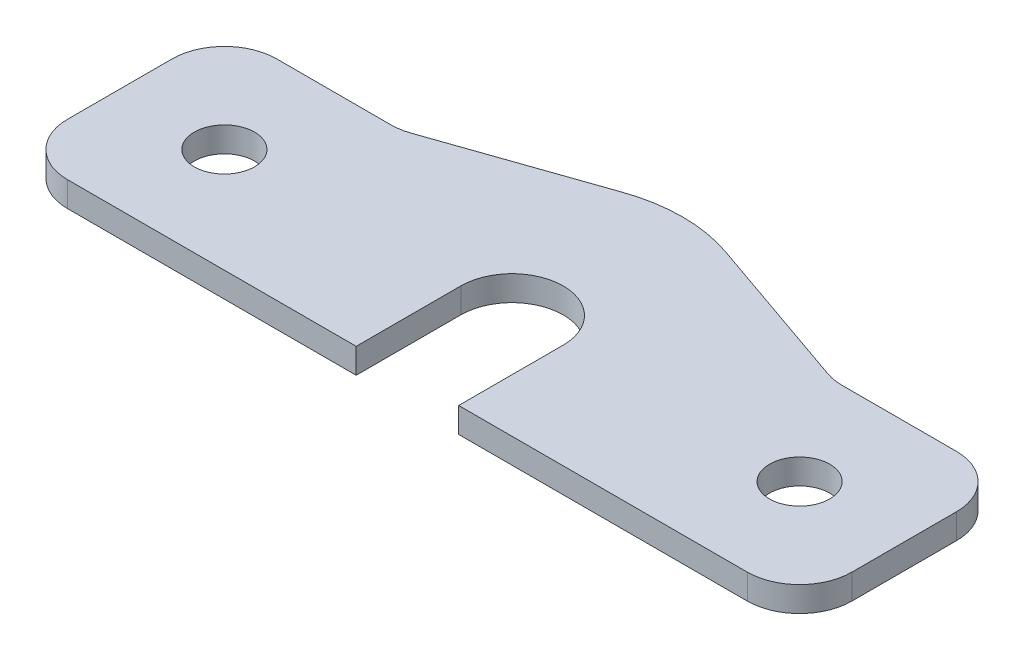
ISO-10303-21;
HEADER;
FILE_DESCRIPTION(('STEP AP214'),'2;1');
FILE_NAME('part.step','',(''),(''),'','','');
FILE_SCHEMA(('AUTOMOTIVE_DESIGN { 1 0 10303 214 1 1 1 1 }'));
ENDSEC;
DATA;
#1=APPLICATION_CONTEXT('core data for automotive mechanical design processes');
#2=APPLICATION_PROTOCOL_DEFINITION('international standard','automotive_design',2000,#1);
#3=PRODUCT_CONTEXT('',#1,'mechanical');
#4=PRODUCT('Part','Part','',(#3));
#5=PRODUCT_RELATED_PRODUCT_CATEGORY('part','',(#4));
#6=PRODUCT_DEFINITION_FORMATION('','',#4);
#7=PRODUCT_DEFINITION_CONTEXT('part definition',#1,'design');
#8=PRODUCT_DEFINITION('design','',#6,#7);
#9=PRODUCT_DEFINITION_SHAPE('','',#8);
#10=(LENGTH_UNIT() NAMED_UNIT(*) SI_UNIT(.MILLI.,.METRE.));
#11=(NAMED_UNIT(*) PLANE_ANGLE_UNIT() SI_UNIT($,.RADIAN.));
#12=(NAMED_UNIT(*) SI_UNIT($,.STERADIAN.) SOLID_ANGLE_UNIT());
#13=UNCERTAINTY_MEASURE_WITH_UNIT(LENGTH_MEASURE(1.E-05),#10,'distance_accuracy_value','');
#14=(GEOMETRIC_REPRESENTATION_CONTEXT(3) GLOBAL_UNCERTAINTY_ASSIGNED_CONTEXT((#13)) GLOBAL_UNIT_ASSIGNED_CONTEXT((#10,
#11,#12)) REPRESENTATION_CONTEXT('',''));
#15=CARTESIAN_POINT('',(0.,0.,0.));
#16=DIRECTION('',(0.,0.,1.));
#17=DIRECTION('',(1.,0.,0.));
#18=AXIS2_PLACEMENT_3D('',#15,#16,#17);
#19=CARTESIAN_POINT('',(0.,1.524,-0.838200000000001));
#20=DIRECTION('',(0.,1.,0.));
#21=DIRECTION('',(0.,0.,1.));
#22=AXIS2_PLACEMENT_3D('',#19,#20,#21);
#23=PLANE('',#22);
#24=CARTESIAN_POINT('',(17.4625,1.524,0.));
#25=DIRECTION('',(0.,1.,0.));
#26=DIRECTION('',(0.,0.,1.));
#27=AXIS2_PLACEMENT_3D('',#24,#25,#26);
#28=CIRCLE('',#27,1.8288);
#29=CARTESIAN_POINT('',(17.4625,1.524,-1.8288));
#30=VERTEX_POINT('',#29);
#31=EDGE_CURVE('E281',#30,#30,#28,.T.);
#32=ORIENTED_EDGE('',*,*,#31,.F.);
#33=EDGE_LOOP('',(#32));
#34=FACE_BOUND('',#33,.T.);
#35=DIRECTION('',(-1.,0.,0.));
#36=VECTOR('',#35,1.);
#37=CARTESIAN_POINT('',(-23.8125,1.524,-6.35));
#38=LINE('',#37,#36);
#39=CARTESIAN_POINT('',(-13.6985419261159,1.524,-6.35));
#40=VERTEX_POINT('',#39);
#41=CARTESIAN_POINT('',(-20.6375,1.524,-6.35));
#42=VERTEX_POINT('',#41);
#43=EDGE_CURVE('E264',#40,#42,#38,.T.);
#44=ORIENTED_EDGE('',*,*,#43,.T.);
#45=CARTESIAN_POINT('',(-20.6375,1.524,-3.175));
#46=DIRECTION('',(0.,1.,0.));
#47=DIRECTION('',(0.,0.,1.));
#48=AXIS2_PLACEMENT_3D('',#45,#46,#47);
#49=CIRCLE('',#48,3.175);
#50=CARTESIAN_POINT('',(-23.8125,1.524,-3.175));
#51=VERTEX_POINT('',#50);
#52=EDGE_CURVE('E224',#42,#51,#49,.T.);
#53=ORIENTED_EDGE('',*,*,#52,.T.);
#54=DIRECTION('',(0.,0.,1.));
#55=VECTOR('',#54,1.);
#56=CARTESIAN_POINT('',(-23.8125,1.524,6.35));
#57=LINE('',#56,#55);
#58=CARTESIAN_POINT('',(-23.8125,1.524,3.175));
#59=VERTEX_POINT('',#58);
#60=EDGE_CURVE('E270',#51,#59,#57,.T.);
#61=ORIENTED_EDGE('',*,*,#60,.T.);
#62=CARTESIAN_POINT('',(-20.6375,1.524,3.175));
#63=DIRECTION('',(0.,1.,0.));
#64=DIRECTION('',(0.,0.,1.));
#65=AXIS2_PLACEMENT_3D('',#62,#63,#64);
#66=CIRCLE('',#65,3.175);
#67=CARTESIAN_POINT('',(-20.6375,1.524,6.35));
#68=VERTEX_POINT('',#67);
#69=EDGE_CURVE('E50',#59,#68,#66,.T.);
#70=ORIENTED_EDGE('',*,*,#69,.T.);
#71=DIRECTION('',(1.,0.,0.));
#72=VECTOR('',#71,1.);
#73=CARTESIAN_POINT('',(-23.8125,1.524,6.35));
#74=LINE('',#73,#72);
#75=CARTESIAN_POINT('',(-3.1115,1.524,6.35));
#76=VERTEX_POINT('',#75);
#77=EDGE_CURVE('E177',#68,#76,#74,.T.);
#78=ORIENTED_EDGE('',*,*,#77,.T.);
#79=DIRECTION('',(0.,0.,-1.));
#80=VECTOR('',#79,1.);
#81=CARTESIAN_POINT('',(-3.1115,1.524,0.));
#82=LINE('',#81,#80);
#83=CARTESIAN_POINT('',(-3.1115,1.524,0.));
#84=VERTEX_POINT('',#83);
#85=EDGE_CURVE('E172',#76,#84,#82,.T.);
#86=ORIENTED_EDGE('',*,*,#85,.T.);
#87=CARTESIAN_POINT('',(0.,1.524,0.));
#88=DIRECTION('',(0.,-1.,0.));
#89=DIRECTION('',(0.,0.,1.));
#90=AXIS2_PLACEMENT_3D('',#87,#88,#89);
#91=CIRCLE('',#90,3.1115);
#92=CARTESIAN_POINT('',(3.1115,1.524,0.));
#93=VERTEX_POINT('',#92);
#94=EDGE_CURVE('E162',#84,#93,#91,.T.);
#95=ORIENTED_EDGE('',*,*,#94,.T.);
#96=DIRECTION('',(0.,0.,1.));
#97=VECTOR('',#96,1.);
#98=CARTESIAN_POINT('',(3.1115,1.524,0.));
#99=LINE('',#98,#97);
#100=CARTESIAN_POINT('',(3.1115,1.524,6.35));
#101=VERTEX_POINT('',#100);
#102=EDGE_CURVE('E171',#93,#101,#99,.T.);
#103=ORIENTED_EDGE('',*,*,#102,.T.);
#104=DIRECTION('',(1.,0.,0.));
#105=VECTOR('',#104,1.);
#106=CARTESIAN_POINT('',(3.1115,1.524,6.35));
#107=LINE('',#106,#105);
#108=CARTESIAN_POINT('',(20.6375,1.524,6.35));
#109=VERTEX_POINT('',#108);
#110=EDGE_CURVE('E313',#101,#109,#107,.T.);
#111=ORIENTED_EDGE('',*,*,#110,.T.);
#112=CARTESIAN_POINT('',(20.6375,1.524,3.175));
#113=DIRECTION('',(0.,1.,0.));
#114=DIRECTION('',(0.,0.,1.));
#115=AXIS2_PLACEMENT_3D('',#112,#113,#114);
#116=CIRCLE('',#115,3.175);
#117=CARTESIAN_POINT('',(23.8125,1.524,3.175));
#118=VERTEX_POINT('',#117);
#119=EDGE_CURVE('E219',#109,#118,#116,.T.);
#120=ORIENTED_EDGE('',*,*,#119,.T.);
#121=DIRECTION('',(0.,0.,-1.));
#122=VECTOR('',#121,1.);
#123=CARTESIAN_POINT('',(23.8125,1.524,6.35));
#124=LINE('',#123,#122);
#125=CARTESIAN_POINT('',(23.8125,1.524,-3.175));
#126=VERTEX_POINT('',#125);
#127=EDGE_CURVE('E321',#118,#126,#124,.T.);
#128=ORIENTED_EDGE('',*,*,#127,.T.);
#129=CARTESIAN_POINT('',(20.6375,1.524,-3.175));
#130=DIRECTION('',(0.,1.,0.));
#131=DIRECTION('',(0.,0.,1.));
#132=AXIS2_PLACEMENT_3D('',#129,#130,#131);
#133=CIRCLE('',#132,3.175);
#134=CARTESIAN_POINT('',(20.6375,1.524,-6.35));
#135=VERTEX_POINT('',#134);
#136=EDGE_CURVE('E222',#126,#135,#133,.T.);
#137=ORIENTED_EDGE('',*,*,#136,.T.);
#138=DIRECTION('',(-1.,0.,0.));
#139=VECTOR('',#138,1.);
#140=CARTESIAN_POINT('',(23.8125,1.524,-6.35));
#141=LINE('',#140,#139);
#142=CARTESIAN_POINT('',(13.6985419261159,1.524,-6.35));
#143=VERTEX_POINT('',#142);
#144=EDGE_CURVE('E323',#135,#143,#141,.T.);
#145=ORIENTED_EDGE('',*,*,#144,.T.);
#146=CARTESIAN_POINT('',(13.6985419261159,1.524,-9.525));
#147=DIRECTION('',(0.,1.,0.));
#148=DIRECTION('',(0.,0.,1.));
#149=AXIS2_PLACEMENT_3D('',#146,#147,#148);
#150=CIRCLE('',#149,3.175);
#151=CARTESIAN_POINT('',(12.6569481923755,1.524,-6.52571550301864));
#152=VERTEX_POINT('',#151);
#153=EDGE_CURVE('E237',#143,#152,#150,.F.);
#154=ORIENTED_EDGE('',*,*,#153,.T.);
#155=DIRECTION('',(-0.94465653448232,0.,-0.328061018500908));
#156=VECTOR('',#155,1.);
#157=CARTESIAN_POINT('',(13.1629235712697,1.524,-6.35));
#158=LINE('',#157,#156);
#159=CARTESIAN_POINT('',(3.12478120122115,1.524,-9.8360534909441));
#160=VERTEX_POINT('',#159);
#161=EDGE_CURVE('E326',#152,#160,#158,.T.);
#162=ORIENTED_EDGE('',*,*,#161,.T.);
#163=CARTESIAN_POINT('',(0.,1.524,-0.838200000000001));
#164=DIRECTION('',(0.,1.,0.));
#165=DIRECTION('',(0.,0.,1.));
#166=AXIS2_PLACEMENT_3D('',#163,#164,#165);
#167=CIRCLE('',#166,9.525);
#168=CARTESIAN_POINT('',(-3.12478120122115,1.524,-9.8360534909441));
#169=VERTEX_POINT('',#168);
#170=EDGE_CURVE('E273',#160,#169,#167,.T.);
#171=ORIENTED_EDGE('',*,*,#170,.T.);
#172=DIRECTION('',(-0.94465653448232,0.,0.328061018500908));
#173=VECTOR('',#172,1.);
#174=CARTESIAN_POINT('',(-13.1629235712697,1.524,-6.35));
#175=LINE('',#174,#173);
#176=CARTESIAN_POINT('',(-12.6569481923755,1.524,-6.52571550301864));
#177=VERTEX_POINT('',#176);
#178=EDGE_CURVE('E266',#169,#177,#175,.T.);
#179=ORIENTED_EDGE('',*,*,#178,.T.);
#180=CARTESIAN_POINT('',(-13.6985419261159,1.524,-9.525));
#181=DIRECTION('',(0.,1.,0.));
#182=DIRECTION('',(0.,0.,1.));
#183=AXIS2_PLACEMENT_3D('',#180,#181,#182);
#184=CIRCLE('',#183,3.175);
#185=EDGE_CURVE('E11',#177,#40,#184,.F.);
#186=ORIENTED_EDGE('',*,*,#185,.T.);
#187=EDGE_LOOP('',(#44,#53,#61,#70,#78,#86,#95,#103,#111,#120,#128,#137,#145,#154,#162,#171,
#179,#186));
#188=FACE_BOUND('',#187,.T.);
#189=CARTESIAN_POINT('',(-17.4625,1.524,0.));
#190=DIRECTION('',(0.,1.,0.));
#191=DIRECTION('',(0.,0.,-1.));
#192=AXIS2_PLACEMENT_3D('',#189,#190,#191);
#193=CIRCLE('',#192,1.8288);
#194=CARTESIAN_POINT('',(-17.4625,1.524,-1.8288));
#195=VERTEX_POINT('',#194);
#196=EDGE_CURVE('E546',#195,#195,#193,.T.);
#197=ORIENTED_EDGE('',*,*,#196,.F.);
#198=EDGE_LOOP('',(#197));
#199=FACE_BOUND('',#198,.T.);
#200=ADVANCED_FACE('F35',(#34,#188,#199),#23,.T.);
#201=CARTESIAN_POINT('',(0.,0.,-0.838200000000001));
#202=DIRECTION('',(0.,1.,0.));
#203=DIRECTION('',(0.,0.,1.));
#204=AXIS2_PLACEMENT_3D('',#201,#202,#203);
#205=PLANE('',#204);
#206=CARTESIAN_POINT('',(17.4625,0.,0.));
#207=DIRECTION('',(0.,1.,0.));
#208=DIRECTION('',(0.,0.,1.));
#209=AXIS2_PLACEMENT_3D('',#206,#207,#208);
#210=CIRCLE('',#209,1.8288);
#211=CARTESIAN_POINT('',(17.4625,0.,-1.8288));
#212=VERTEX_POINT('',#211);
#213=EDGE_CURVE('E545',#212,#212,#210,.T.);
#214=ORIENTED_EDGE('',*,*,#213,.T.);
#215=EDGE_LOOP('',(#214));
#216=FACE_BOUND('',#215,.T.);
#217=DIRECTION('',(0.,0.,1.));
#218=VECTOR('',#217,1.);
#219=CARTESIAN_POINT('',(-23.8125,0.,6.35));
#220=LINE('',#219,#218);
#221=CARTESIAN_POINT('',(-23.8125,0.,-3.175));
#222=VERTEX_POINT('',#221);
#223=CARTESIAN_POINT('',(-23.8125,0.,3.175));
#224=VERTEX_POINT('',#223);
#225=EDGE_CURVE('E297',#222,#224,#220,.T.);
#226=ORIENTED_EDGE('',*,*,#225,.F.);
#227=CARTESIAN_POINT('',(-20.6375,0.,-3.175));
#228=DIRECTION('',(0.,1.,0.));
#229=DIRECTION('',(0.,0.,1.));
#230=AXIS2_PLACEMENT_3D('',#227,#228,#229);
#231=CIRCLE('',#230,3.175);
#232=CARTESIAN_POINT('',(-20.6375,0.,-6.35));
#233=VERTEX_POINT('',#232);
#234=EDGE_CURVE('E217',#222,#233,#231,.F.);
#235=ORIENTED_EDGE('',*,*,#234,.T.);
#236=DIRECTION('',(-1.,0.,0.));
#237=VECTOR('',#236,1.);
#238=CARTESIAN_POINT('',(-23.8125,0.,-6.35));
#239=LINE('',#238,#237);
#240=CARTESIAN_POINT('',(-13.6985419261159,0.,-6.35));
#241=VERTEX_POINT('',#240);
#242=EDGE_CURVE('E248',#241,#233,#239,.T.);
#243=ORIENTED_EDGE('',*,*,#242,.F.);
#244=CARTESIAN_POINT('',(-13.6985419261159,0.,-9.525));
#245=DIRECTION('',(0.,1.,0.));
#246=DIRECTION('',(0.,0.,1.));
#247=AXIS2_PLACEMENT_3D('',#244,#245,#246);
#248=CIRCLE('',#247,3.175);
#249=CARTESIAN_POINT('',(-12.6569481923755,0.,-6.52571550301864));
#250=VERTEX_POINT('',#249);
#251=EDGE_CURVE('E43',#241,#250,#248,.T.);
#252=ORIENTED_EDGE('',*,*,#251,.T.);
#253=DIRECTION('',(-0.94465653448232,0.,0.328061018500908));
#254=VECTOR('',#253,1.);
#255=CARTESIAN_POINT('',(-13.1629235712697,0.,-6.35));
#256=LINE('',#255,#254);
#257=CARTESIAN_POINT('',(-3.12478120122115,0.,-9.8360534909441));
#258=VERTEX_POINT('',#257);
#259=EDGE_CURVE('E246',#258,#250,#256,.T.);
#260=ORIENTED_EDGE('',*,*,#259,.F.);
#261=CARTESIAN_POINT('',(0.,0.,-0.838200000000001));
#262=DIRECTION('',(0.,1.,0.));
#263=DIRECTION('',(0.,0.,1.));
#264=AXIS2_PLACEMENT_3D('',#261,#262,#263);
#265=CIRCLE('',#264,9.525);
#266=CARTESIAN_POINT('',(3.12478120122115,0.,-9.8360534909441));
#267=VERTEX_POINT('',#266);
#268=EDGE_CURVE('E259',#267,#258,#265,.T.);
#269=ORIENTED_EDGE('',*,*,#268,.F.);
#270=DIRECTION('',(-0.94465653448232,0.,-0.328061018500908));
#271=VECTOR('',#270,1.);
#272=CARTESIAN_POINT('',(13.1629235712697,0.,-6.35));
#273=LINE('',#272,#271);
#274=CARTESIAN_POINT('',(12.6569481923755,0.,-6.52571550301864));
#275=VERTEX_POINT('',#274);
#276=EDGE_CURVE('E293',#275,#267,#273,.T.);
#277=ORIENTED_EDGE('',*,*,#276,.F.);
#278=CARTESIAN_POINT('',(13.6985419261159,0.,-9.525));
#279=DIRECTION('',(0.,1.,0.));
#280=DIRECTION('',(0.,0.,1.));
#281=AXIS2_PLACEMENT_3D('',#278,#279,#280);
#282=CIRCLE('',#281,3.175);
#283=CARTESIAN_POINT('',(13.6985419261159,0.,-6.35));
#284=VERTEX_POINT('',#283);
#285=EDGE_CURVE('E235',#275,#284,#282,.T.);
#286=ORIENTED_EDGE('',*,*,#285,.T.);
#287=DIRECTION('',(-1.,0.,0.));
#288=VECTOR('',#287,1.);
#289=CARTESIAN_POINT('',(23.8125,0.,-6.35));
#290=LINE('',#289,#288);
#291=CARTESIAN_POINT('',(20.6375,0.,-6.35));
#292=VERTEX_POINT('',#291);
#293=EDGE_CURVE('E290',#292,#284,#290,.T.);
#294=ORIENTED_EDGE('',*,*,#293,.F.);
#295=CARTESIAN_POINT('',(20.6375,0.,-3.175));
#296=DIRECTION('',(0.,1.,0.));
#297=DIRECTION('',(0.,0.,1.));
#298=AXIS2_PLACEMENT_3D('',#295,#296,#297);
#299=CIRCLE('',#298,3.175);
#300=CARTESIAN_POINT('',(23.8125,0.,-3.175));
#301=VERTEX_POINT('',#300);
#302=EDGE_CURVE('E215',#292,#301,#299,.F.);
#303=ORIENTED_EDGE('',*,*,#302,.T.);
#304=DIRECTION('',(0.,0.,-1.));
#305=VECTOR('',#304,1.);
#306=CARTESIAN_POINT('',(23.8125,0.,6.35));
#307=LINE('',#306,#305);
#308=CARTESIAN_POINT('',(23.8125,0.,3.175));
#309=VERTEX_POINT('',#308);
#310=EDGE_CURVE('E288',#309,#301,#307,.T.);
#311=ORIENTED_EDGE('',*,*,#310,.F.);
#312=CARTESIAN_POINT('',(20.6375,0.,3.175));
#313=DIRECTION('',(0.,1.,0.));
#314=DIRECTION('',(0.,0.,1.));
#315=AXIS2_PLACEMENT_3D('',#312,#313,#314);
#316=CIRCLE('',#315,3.175);
#317=CARTESIAN_POINT('',(20.6375,0.,6.35));
#318=VERTEX_POINT('',#317);
#319=EDGE_CURVE('E211',#309,#318,#316,.F.);
#320=ORIENTED_EDGE('',*,*,#319,.T.);
#321=DIRECTION('',(1.,0.,0.));
#322=VECTOR('',#321,1.);
#323=CARTESIAN_POINT('',(3.1115,0.,6.35));
#324=LINE('',#323,#322);
#325=CARTESIAN_POINT('',(3.1115,0.,6.35));
#326=VERTEX_POINT('',#325);
#327=EDGE_CURVE('E285',#326,#318,#324,.T.);
#328=ORIENTED_EDGE('',*,*,#327,.F.);
#329=DIRECTION('',(0.,0.,1.));
#330=VECTOR('',#329,1.);
#331=CARTESIAN_POINT('',(3.1115,0.,0.));
#332=LINE('',#331,#330);
#333=CARTESIAN_POINT('',(3.1115,0.,0.));
#334=VERTEX_POINT('',#333);
#335=EDGE_CURVE('E283',#334,#326,#332,.T.);
#336=ORIENTED_EDGE('',*,*,#335,.F.);
#337=CARTESIAN_POINT('',(0.,0.,0.));
#338=DIRECTION('',(0.,-1.,0.));
#339=DIRECTION('',(0.,0.,1.));
#340=AXIS2_PLACEMENT_3D('',#337,#338,#339);
#341=CIRCLE('',#340,3.1115);
#342=CARTESIAN_POINT('',(-3.1115,0.,0.));
#343=VERTEX_POINT('',#342);
#344=EDGE_CURVE('E280',#343,#334,#341,.T.);
#345=ORIENTED_EDGE('',*,*,#344,.F.);
#346=DIRECTION('',(0.,0.,-1.));
#347=VECTOR('',#346,1.);
#348=CARTESIAN_POINT('',(-3.1115,0.,0.));
#349=LINE('',#348,#347);
#350=CARTESIAN_POINT('',(-3.1115,0.,6.35));
#351=VERTEX_POINT('',#350);
#352=EDGE_CURVE('E185',#351,#343,#349,.T.);
#353=ORIENTED_EDGE('',*,*,#352,.F.);
#354=DIRECTION('',(1.,0.,0.));
#355=VECTOR('',#354,1.);
#356=CARTESIAN_POINT('',(-23.8125,0.,6.35));
#357=LINE('',#356,#355);
#358=CARTESIAN_POINT('',(-20.6375,0.,6.35));
#359=VERTEX_POINT('',#358);
#360=EDGE_CURVE('E181',#359,#351,#357,.T.);
#361=ORIENTED_EDGE('',*,*,#360,.F.);
#362=CARTESIAN_POINT('',(-20.6375,0.,3.175));
#363=DIRECTION('',(0.,1.,0.));
#364=DIRECTION('',(0.,0.,1.));
#365=AXIS2_PLACEMENT_3D('',#362,#363,#364);
#366=CIRCLE('',#365,3.175);
#367=EDGE_CURVE('E213',#359,#224,#366,.F.);
#368=ORIENTED_EDGE('',*,*,#367,.T.);
#369=EDGE_LOOP('',(#226,#235,#243,#252,#260,#269,#277,#286,#294,#303,#311,#320,#328,#336,#345,
#353,#361,#368));
#370=FACE_BOUND('',#369,.T.);
#371=CARTESIAN_POINT('',(-17.4625,0.,0.));
#372=DIRECTION('',(0.,1.,0.));
#373=DIRECTION('',(0.,0.,-1.));
#374=AXIS2_PLACEMENT_3D('',#371,#372,#373);
#375=CIRCLE('',#374,1.8288);
#376=CARTESIAN_POINT('',(-17.4625,0.,-1.8288));
#377=VERTEX_POINT('',#376);
#378=EDGE_CURVE('E550',#377,#377,#375,.T.);
#379=ORIENTED_EDGE('',*,*,#378,.T.);
#380=EDGE_LOOP('',(#379));
#381=FACE_BOUND('',#380,.T.);
#382=ADVANCED_FACE('F243',(#216,#370,#381),#205,.F.);
#383=CARTESIAN_POINT('',(-3.1115,1.524,0.));
#384=DIRECTION('',(-1.,0.,0.));
#385=DIRECTION('',(0.,0.,1.));
#386=AXIS2_PLACEMENT_3D('',#383,#384,#385);
#387=PLANE('',#386);
#388=ORIENTED_EDGE('',*,*,#352,.T.);
#389=DIRECTION('',(0.,-1.,0.));
#390=VECTOR('',#389,1.);
#391=CARTESIAN_POINT('',(-3.1115,1.524,0.));
#392=LINE('',#391,#390);
#393=EDGE_CURVE('E166',#84,#343,#392,.T.);
#394=ORIENTED_EDGE('',*,*,#393,.F.);
#395=ORIENTED_EDGE('',*,*,#85,.F.);
#396=DIRECTION('',(0.,-1.,0.));
#397=VECTOR('',#396,1.);
#398=CARTESIAN_POINT('',(-3.1115,1.524,6.35));
#399=LINE('',#398,#397);
#400=EDGE_CURVE('E278',#76,#351,#399,.T.);
#401=ORIENTED_EDGE('',*,*,#400,.T.);
#402=EDGE_LOOP('',(#388,#394,#395,#401));
#403=FACE_BOUND('',#402,.T.);
#404=ADVANCED_FACE('F183',(#403),#387,.F.);
#405=CARTESIAN_POINT('',(0.,1.524,0.));
#406=DIRECTION('',(0.,-1.,0.));
#407=DIRECTION('',(0.,0.,-1.));
#408=AXIS2_PLACEMENT_3D('',#405,#406,#407);
#409=CYLINDRICAL_SURFACE('',#408,3.1115);
#410=ORIENTED_EDGE('',*,*,#344,.T.);
#411=DIRECTION('',(0.,-1.,0.));
#412=VECTOR('',#411,1.);
#413=CARTESIAN_POINT('',(3.1115,1.524,0.));
#414=LINE('',#413,#412);
#415=EDGE_CURVE('E169',#93,#334,#414,.T.);
#416=ORIENTED_EDGE('',*,*,#415,.F.);
#417=ORIENTED_EDGE('',*,*,#94,.F.);
#418=ORIENTED_EDGE('',*,*,#393,.T.);
#419=EDGE_LOOP('',(#410,#416,#417,#418));
#420=FACE_BOUND('',#419,.T.);
#421=ADVANCED_FACE('F164',(#420),#409,.F.);
#422=CARTESIAN_POINT('',(3.1115,1.524,0.));
#423=DIRECTION('',(1.,0.,0.));
#424=DIRECTION('',(0.,0.,-1.));
#425=AXIS2_PLACEMENT_3D('',#422,#423,#424);
#426=PLANE('',#425);
#427=ORIENTED_EDGE('',*,*,#335,.T.);
#428=DIRECTION('',(0.,-1.,0.));
#429=VECTOR('',#428,1.);
#430=CARTESIAN_POINT('',(3.1115,1.524,6.35));
#431=LINE('',#430,#429);
#432=EDGE_CURVE('E191',#101,#326,#431,.T.);
#433=ORIENTED_EDGE('',*,*,#432,.F.);
#434=ORIENTED_EDGE('',*,*,#102,.F.);
#435=ORIENTED_EDGE('',*,*,#415,.T.);
#436=EDGE_LOOP('',(#427,#433,#434,#435));
#437=FACE_BOUND('',#436,.T.);
#438=ADVANCED_FACE('F397',(#437),#426,.F.);
#439=CARTESIAN_POINT('',(3.1115,1.524,6.35));
#440=DIRECTION('',(0.,0.,-1.));
#441=DIRECTION('',(-1.,0.,0.));
#442=AXIS2_PLACEMENT_3D('',#439,#440,#441);
#443=PLANE('',#442);
#444=ORIENTED_EDGE('',*,*,#327,.T.);
#445=DIRECTION('',(0.,-1.,0.));
#446=VECTOR('',#445,1.);
#447=CARTESIAN_POINT('',(20.6375,1.524,6.35));
#448=LINE('',#447,#446);
#449=EDGE_CURVE('E233',#318,#109,#448,.F.);
#450=ORIENTED_EDGE('',*,*,#449,.T.);
#451=ORIENTED_EDGE('',*,*,#110,.F.);
#452=ORIENTED_EDGE('',*,*,#432,.T.);
#453=EDGE_LOOP('',(#444,#450,#451,#452));
#454=FACE_BOUND('',#453,.T.);
#455=ADVANCED_FACE('F310',(#454),#443,.F.);
#456=CARTESIAN_POINT('',(23.8125,1.524,6.35));
#457=DIRECTION('',(-1.,0.,0.));
#458=DIRECTION('',(0.,0.,1.));
#459=AXIS2_PLACEMENT_3D('',#456,#457,#458);
#460=PLANE('',#459);
#461=ORIENTED_EDGE('',*,*,#310,.T.);
#462=DIRECTION('',(0.,-1.,0.));
#463=VECTOR('',#462,1.);
#464=CARTESIAN_POINT('',(23.8125,1.524,-3.175));
#465=LINE('',#464,#463);
#466=EDGE_CURVE('E58',#301,#126,#465,.F.);
#467=ORIENTED_EDGE('',*,*,#466,.T.);
#468=ORIENTED_EDGE('',*,*,#127,.F.);
#469=DIRECTION('',(0.,-1.,0.));
#470=VECTOR('',#469,1.);
#471=CARTESIAN_POINT('',(23.8125,1.524,3.175));
#472=LINE('',#471,#470);
#473=EDGE_CURVE('E226',#118,#309,#472,.T.);
#474=ORIENTED_EDGE('',*,*,#473,.T.);
#475=EDGE_LOOP('',(#461,#467,#468,#474));
#476=FACE_BOUND('',#475,.T.);
#477=ADVANCED_FACE('F320',(#476),#460,.F.);
#478=CARTESIAN_POINT('',(23.8125,1.524,-6.35));
#479=DIRECTION('',(0.,0.,1.));
#480=DIRECTION('',(1.,0.,0.));
#481=AXIS2_PLACEMENT_3D('',#478,#479,#480);
#482=PLANE('',#481);
#483=ORIENTED_EDGE('',*,*,#293,.T.);
#484=DIRECTION('',(0.,-1.,0.));
#485=VECTOR('',#484,1.);
#486=CARTESIAN_POINT('',(13.6985419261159,1.524,-6.35));
#487=LINE('',#486,#485);
#488=EDGE_CURVE('E197',#284,#143,#487,.F.);
#489=ORIENTED_EDGE('',*,*,#488,.T.);
#490=ORIENTED_EDGE('',*,*,#144,.F.);
#491=DIRECTION('',(0.,-1.,0.));
#492=VECTOR('',#491,1.);
#493=CARTESIAN_POINT('',(20.6375,1.524,-6.35));
#494=LINE('',#493,#492);
#495=EDGE_CURVE('E189',#135,#292,#494,.T.);
#496=ORIENTED_EDGE('',*,*,#495,.T.);
#497=EDGE_LOOP('',(#483,#489,#490,#496));
#498=FACE_BOUND('',#497,.T.);
#499=ADVANCED_FACE('F347',(#498),#482,.F.);
#500=CARTESIAN_POINT('',(13.1629235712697,1.524,-6.35));
#501=DIRECTION('',(-0.328061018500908,0.,0.94465653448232));
#502=DIRECTION('',(0.94465653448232,0.,0.328061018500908));
#503=AXIS2_PLACEMENT_3D('',#500,#501,#502);
#504=PLANE('',#503);
#505=ORIENTED_EDGE('',*,*,#161,.F.);
#506=DIRECTION('',(0.,-1.,0.));
#507=VECTOR('',#506,1.);
#508=CARTESIAN_POINT('',(12.6569481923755,0.,-6.52571550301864));
#509=LINE('',#508,#507);
#510=EDGE_CURVE('E186',#152,#275,#509,.T.);
#511=ORIENTED_EDGE('',*,*,#510,.T.);
#512=ORIENTED_EDGE('',*,*,#276,.T.);
#513=DIRECTION('',(0.,-1.,0.));
#514=VECTOR('',#513,1.);
#515=CARTESIAN_POINT('',(3.12478120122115,1.524,-9.8360534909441));
#516=LINE('',#515,#514);
#517=EDGE_CURVE('E303',#160,#267,#516,.T.);
#518=ORIENTED_EDGE('',*,*,#517,.F.);
#519=EDGE_LOOP('',(#505,#511,#512,#518));
#520=FACE_BOUND('',#519,.T.);
#521=ADVANCED_FACE('F339',(#520),#504,.F.);
#522=CARTESIAN_POINT('',(0.,1.524,-0.838200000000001));
#523=DIRECTION('',(0.,-1.,0.));
#524=DIRECTION('',(0.,0.,-1.));
#525=AXIS2_PLACEMENT_3D('',#522,#523,#524);
#526=CYLINDRICAL_SURFACE('',#525,9.525);
#527=ORIENTED_EDGE('',*,*,#268,.T.);
#528=DIRECTION('',(0.,-1.,0.));
#529=VECTOR('',#528,1.);
#530=CARTESIAN_POINT('',(-3.12478120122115,1.524,-9.8360534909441));
#531=LINE('',#530,#529);
#532=EDGE_CURVE('E258',#169,#258,#531,.T.);
#533=ORIENTED_EDGE('',*,*,#532,.F.);
#534=ORIENTED_EDGE('',*,*,#170,.F.);
#535=ORIENTED_EDGE('',*,*,#517,.T.);
#536=EDGE_LOOP('',(#527,#533,#534,#535));
#537=FACE_BOUND('',#536,.T.);
#538=ADVANCED_FACE('F335',(#537),#526,.T.);
#539=CARTESIAN_POINT('',(-13.1629235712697,1.524,-6.35));
#540=DIRECTION('',(0.328061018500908,0.,0.94465653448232));
#541=DIRECTION('',(0.94465653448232,0.,-0.328061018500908));
#542=AXIS2_PLACEMENT_3D('',#539,#540,#541);
#543=PLANE('',#542);
#544=ORIENTED_EDGE('',*,*,#259,.T.);
#545=DIRECTION('',(0.,-1.,0.));
#546=VECTOR('',#545,1.);
#547=CARTESIAN_POINT('',(-12.6569481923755,1.524,-6.52571550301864));
#548=LINE('',#547,#546);
#549=EDGE_CURVE('E204',#250,#177,#548,.F.);
#550=ORIENTED_EDGE('',*,*,#549,.T.);
#551=ORIENTED_EDGE('',*,*,#178,.F.);
#552=ORIENTED_EDGE('',*,*,#532,.T.);
#553=EDGE_LOOP('',(#544,#550,#551,#552));
#554=FACE_BOUND('',#553,.T.);
#555=ADVANCED_FACE('F254',(#554),#543,.F.);
#556=CARTESIAN_POINT('',(-23.8125,1.524,-6.35));
#557=DIRECTION('',(0.,0.,1.));
#558=DIRECTION('',(1.,0.,0.));
#559=AXIS2_PLACEMENT_3D('',#556,#557,#558);
#560=PLANE('',#559);
#561=ORIENTED_EDGE('',*,*,#43,.F.);
#562=DIRECTION('',(0.,-1.,0.));
#563=VECTOR('',#562,1.);
#564=CARTESIAN_POINT('',(-13.6985419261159,0.,-6.35));
#565=LINE('',#564,#563);
#566=EDGE_CURVE('E201',#40,#241,#565,.T.);
#567=ORIENTED_EDGE('',*,*,#566,.T.);
#568=ORIENTED_EDGE('',*,*,#242,.T.);
#569=DIRECTION('',(0.,-1.,0.));
#570=VECTOR('',#569,1.);
#571=CARTESIAN_POINT('',(-20.6375,1.524,-6.35));
#572=LINE('',#571,#570);
#573=EDGE_CURVE('E199',#233,#42,#572,.F.);
#574=ORIENTED_EDGE('',*,*,#573,.T.);
#575=EDGE_LOOP('',(#561,#567,#568,#574));
#576=FACE_BOUND('',#575,.T.);
#577=ADVANCED_FACE('F268',(#576),#560,.F.);
#578=CARTESIAN_POINT('',(-23.8125,1.524,6.35));
#579=DIRECTION('',(1.,0.,0.));
#580=DIRECTION('',(0.,0.,-1.));
#581=AXIS2_PLACEMENT_3D('',#578,#579,#580);
#582=PLANE('',#581);
#583=ORIENTED_EDGE('',*,*,#60,.F.);
#584=DIRECTION('',(0.,-1.,0.));
#585=VECTOR('',#584,1.);
#586=CARTESIAN_POINT('',(-23.8125,1.524,-3.175));
#587=LINE('',#586,#585);
#588=EDGE_CURVE('E208',#51,#222,#587,.T.);
#589=ORIENTED_EDGE('',*,*,#588,.T.);
#590=ORIENTED_EDGE('',*,*,#225,.T.);
#591=DIRECTION('',(0.,-1.,0.));
#592=VECTOR('',#591,1.);
#593=CARTESIAN_POINT('',(-23.8125,1.524,3.175));
#594=LINE('',#593,#592);
#595=EDGE_CURVE('E206',#224,#59,#594,.F.);
#596=ORIENTED_EDGE('',*,*,#595,.T.);
#597=EDGE_LOOP('',(#583,#589,#590,#596));
#598=FACE_BOUND('',#597,.T.);
#599=ADVANCED_FACE('F378',(#598),#582,.F.);
#600=CARTESIAN_POINT('',(-23.8125,1.524,6.35));
#601=DIRECTION('',(0.,0.,-1.));
#602=DIRECTION('',(-1.,0.,0.));
#603=AXIS2_PLACEMENT_3D('',#600,#601,#602);
#604=PLANE('',#603);
#605=ORIENTED_EDGE('',*,*,#77,.F.);
#606=DIRECTION('',(0.,-1.,0.));
#607=VECTOR('',#606,1.);
#608=CARTESIAN_POINT('',(-20.6375,1.524,6.35));
#609=LINE('',#608,#607);
#610=EDGE_CURVE('E230',#68,#359,#609,.T.);
#611=ORIENTED_EDGE('',*,*,#610,.T.);
#612=ORIENTED_EDGE('',*,*,#360,.T.);
#613=ORIENTED_EDGE('',*,*,#400,.F.);
#614=EDGE_LOOP('',(#605,#611,#612,#613));
#615=FACE_BOUND('',#614,.T.);
#616=ADVANCED_FACE('F375',(#615),#604,.F.);
#617=CARTESIAN_POINT('',(17.4625,1.524,0.));
#618=DIRECTION('',(0.,-1.,0.));
#619=DIRECTION('',(0.,0.,-1.));
#620=AXIS2_PLACEMENT_3D('',#617,#618,#619);
#621=CYLINDRICAL_SURFACE('',#620,1.8288);
#622=CARTESIAN_POINT('',(17.4625,1.524,-1.8288));
#623=CARTESIAN_POINT('',(17.4625,1.508125,-1.8288));
#624=CARTESIAN_POINT('',(17.4625,1.49225,-1.8288));
#625=CARTESIAN_POINT('',(17.4625,1.4605,-1.8288));
#626=CARTESIAN_POINT('',(17.4625,1.444625,-1.8288));
#627=CARTESIAN_POINT('',(17.4625,1.412875,-1.8288));
#628=CARTESIAN_POINT('',(17.4625,1.397,-1.8288));
#629=CARTESIAN_POINT('',(17.4625,1.36525,-1.8288));
#630=CARTESIAN_POINT('',(17.4625,1.349375,-1.8288));
#631=CARTESIAN_POINT('',(17.4625,1.317625,-1.8288));
#632=CARTESIAN_POINT('',(17.4625,1.30175,-1.8288));
#633=CARTESIAN_POINT('',(17.4625,1.27,-1.8288));
#634=CARTESIAN_POINT('',(17.4625,1.254125,-1.8288));
#635=CARTESIAN_POINT('',(17.4625,1.222375,-1.8288));
#636=CARTESIAN_POINT('',(17.4625,1.2065,-1.8288));
#637=CARTESIAN_POINT('',(17.4625,1.17475,-1.8288));
#638=CARTESIAN_POINT('',(17.4625,1.158875,-1.8288));
#639=CARTESIAN_POINT('',(17.4625,1.127125,-1.8288));
#640=CARTESIAN_POINT('',(17.4625,1.11125,-1.8288));
#641=CARTESIAN_POINT('',(17.4625,1.0795,-1.8288));
#642=CARTESIAN_POINT('',(17.4625,1.063625,-1.8288));
#643=CARTESIAN_POINT('',(17.4625,1.031875,-1.8288));
#644=CARTESIAN_POINT('',(17.4625,1.016,-1.8288));
#645=CARTESIAN_POINT('',(17.4625,0.98425,-1.8288));
#646=CARTESIAN_POINT('',(17.4625,0.968375,-1.8288));
#647=CARTESIAN_POINT('',(17.4625,0.936625,-1.8288));
#648=CARTESIAN_POINT('',(17.4625,0.92075,-1.8288));
#649=CARTESIAN_POINT('',(17.4625,0.889,-1.8288));
#650=CARTESIAN_POINT('',(17.4625,0.873125,-1.8288));
#651=CARTESIAN_POINT('',(17.4625,0.841375,-1.8288));
#652=CARTESIAN_POINT('',(17.4625,0.8255,-1.8288));
#653=CARTESIAN_POINT('',(17.4625,0.79375,-1.8288));
#654=CARTESIAN_POINT('',(17.4625,0.777875,-1.8288));
#655=CARTESIAN_POINT('',(17.4625,0.746125,-1.8288));
#656=CARTESIAN_POINT('',(17.4625,0.73025,-1.8288));
#657=CARTESIAN_POINT('',(17.4625,0.6985,-1.8288));
#658=CARTESIAN_POINT('',(17.4625,0.682625,-1.8288));
#659=CARTESIAN_POINT('',(17.4625,0.650875,-1.8288));
#660=CARTESIAN_POINT('',(17.4625,0.635,-1.8288));
#661=CARTESIAN_POINT('',(17.4625,0.60325,-1.8288));
#662=CARTESIAN_POINT('',(17.4625,0.587375,-1.8288));
#663=CARTESIAN_POINT('',(17.4625,0.555625,-1.8288));
#664=CARTESIAN_POINT('',(17.4625,0.53975,-1.8288));
#665=CARTESIAN_POINT('',(17.4625,0.508,-1.8288));
#666=CARTESIAN_POINT('',(17.4625,0.492125,-1.8288));
#667=CARTESIAN_POINT('',(17.4625,0.460375,-1.8288));
#668=CARTESIAN_POINT('',(17.4625,0.4445,-1.8288));
#669=CARTESIAN_POINT('',(17.4625,0.41275,-1.8288));
#670=CARTESIAN_POINT('',(17.4625,0.396875,-1.8288));
#671=CARTESIAN_POINT('',(17.4625,0.365125,-1.8288));
#672=CARTESIAN_POINT('',(17.4625,0.34925,-1.8288));
#673=CARTESIAN_POINT('',(17.4625,0.3175,-1.8288));
#674=CARTESIAN_POINT('',(17.4625,0.301625,-1.8288));
#675=CARTESIAN_POINT('',(17.4625,0.269875,-1.8288));
#676=CARTESIAN_POINT('',(17.4625,0.254,-1.8288));
#677=CARTESIAN_POINT('',(17.4625,0.22225,-1.8288));
#678=CARTESIAN_POINT('',(17.4625,0.206375,-1.8288));
#679=CARTESIAN_POINT('',(17.4625,0.174625,-1.8288));
#680=CARTESIAN_POINT('',(17.4625,0.15875,-1.8288));
#681=CARTESIAN_POINT('',(17.4625,0.127,-1.8288));
#682=CARTESIAN_POINT('',(17.4625,0.111125,-1.8288));
#683=CARTESIAN_POINT('',(17.4625,0.079375,-1.8288));
#684=CARTESIAN_POINT('',(17.4625,0.0635,-1.8288));
#685=CARTESIAN_POINT('',(17.4625,0.0317499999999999,-1.8288));
#686=CARTESIAN_POINT('',(17.4625,0.015875,-1.8288));
#687=CARTESIAN_POINT('',(17.4625,0.,-1.8288));
#688=B_SPLINE_CURVE_WITH_KNOTS('',3,(#622,#623,#624,#625,#626,#627,#628,#629,#630,#631,#632,
#633,#634,#635,#636,#637,#638,#639,#640,#641,#642,#643,#644,#645,#646,#647,#648,#649,#650,#651,
#652,#653,#654,#655,#656,#657,#658,#659,#660,#661,#662,#663,#664,#665,#666,#667,#668,#669,#670,
#671,#672,#673,#674,#675,#676,#677,#678,#679,#680,#681,#682,#683,#684,#685,#686,#687),
.UNSPECIFIED.,.F.,.F.,(4,2,2,2,2,2,2,2,2,2,2,2,2,2,2,2,2,2,2,2,2,2,2,2,2,2,2,2,2,2,2,2,4),(0.,
0.0476249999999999,0.0952499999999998,0.142875,0.1905,0.238125,0.28575,0.333375,0.381,0.428625,
0.47625,0.523875,0.5715,0.619125,0.66675,0.714375,0.762,0.809625,0.85725,0.904875,0.9525,
1.000125,1.04775,1.095375,1.143,1.190625,1.23825,1.285875,1.3335,1.381125,1.42875,1.476375,
1.524),.UNSPECIFIED.);
#689=EDGE_CURVE('BSEAM372',#30,#212,#688,.T.);
#690=ORIENTED_EDGE('',*,*,#31,.T.);
#691=ORIENTED_EDGE('',*,*,#213,.F.);
#692=ORIENTED_EDGE('',*,*,#689,.T.);
#693=ORIENTED_EDGE('',*,*,#689,.F.);
#694=EDGE_LOOP('',(#690,#692,#691,#693));
#695=FACE_BOUND('',#694,.T.);
#696=ADVANCED_FACE('F372',(#695),#621,.F.);
#697=CARTESIAN_POINT('',(-17.4625,1.524,0.));
#698=DIRECTION('',(0.,-1.,0.));
#699=DIRECTION('',(0.,0.,-1.));
#700=AXIS2_PLACEMENT_3D('',#697,#698,#699);
#701=CYLINDRICAL_SURFACE('',#700,1.8288);
#702=CARTESIAN_POINT('',(-17.4625,1.524,-1.8288));
#703=CARTESIAN_POINT('',(-17.4625,1.508125,-1.8288));
#704=CARTESIAN_POINT('',(-17.4625,1.49225,-1.8288));
#705=CARTESIAN_POINT('',(-17.4625,1.4605,-1.8288));
#706=CARTESIAN_POINT('',(-17.4625,1.444625,-1.8288));
#707=CARTESIAN_POINT('',(-17.4625,1.412875,-1.8288));
#708=CARTESIAN_POINT('',(-17.4625,1.397,-1.8288));
#709=CARTESIAN_POINT('',(-17.4625,1.36525,-1.8288));
#710=CARTESIAN_POINT('',(-17.4625,1.349375,-1.8288));
#711=CARTESIAN_POINT('',(-17.4625,1.317625,-1.8288));
#712=CARTESIAN_POINT('',(-17.4625,1.30175,-1.8288));
#713=CARTESIAN_POINT('',(-17.4625,1.27,-1.8288));
#714=CARTESIAN_POINT('',(-17.4625,1.254125,-1.8288));
#715=CARTESIAN_POINT('',(-17.4625,1.222375,-1.8288));
#716=CARTESIAN_POINT('',(-17.4625,1.2065,-1.8288));
#717=CARTESIAN_POINT('',(-17.4625,1.17475,-1.8288));
#718=CARTESIAN_POINT('',(-17.4625,1.158875,-1.8288));
#719=CARTESIAN_POINT('',(-17.4625,1.127125,-1.8288));
#720=CARTESIAN_POINT('',(-17.4625,1.11125,-1.8288));
#721=CARTESIAN_POINT('',(-17.4625,1.0795,-1.8288));
#722=CARTESIAN_POINT('',(-17.4625,1.063625,-1.8288));
#723=CARTESIAN_POINT('',(-17.4625,1.031875,-1.8288));
#724=CARTESIAN_POINT('',(-17.4625,1.016,-1.8288));
#725=CARTESIAN_POINT('',(-17.4625,0.98425,-1.8288));
#726=CARTESIAN_POINT('',(-17.4625,0.968375,-1.8288));
#727=CARTESIAN_POINT('',(-17.4625,0.936625,-1.8288));
#728=CARTESIAN_POINT('',(-17.4625,0.92075,-1.8288));
#729=CARTESIAN_POINT('',(-17.4625,0.889,-1.8288));
#730=CARTESIAN_POINT('',(-17.4625,0.873125,-1.8288));
#731=CARTESIAN_POINT('',(-17.4625,0.841375,-1.8288));
#732=CARTESIAN_POINT('',(-17.4625,0.8255,-1.8288));
#733=CARTESIAN_POINT('',(-17.4625,0.79375,-1.8288));
#734=CARTESIAN_POINT('',(-17.4625,0.777875,-1.8288));
#735=CARTESIAN_POINT('',(-17.4625,0.746125,-1.8288));
#736=CARTESIAN_POINT('',(-17.4625,0.73025,-1.8288));
#737=CARTESIAN_POINT('',(-17.4625,0.6985,-1.8288));
#738=CARTESIAN_POINT('',(-17.4625,0.682625,-1.8288));
#739=CARTESIAN_POINT('',(-17.4625,0.650875,-1.8288));
#740=CARTESIAN_POINT('',(-17.4625,0.635,-1.8288));
#741=CARTESIAN_POINT('',(-17.4625,0.60325,-1.8288));
#742=CARTESIAN_POINT('',(-17.4625,0.587375,-1.8288));
#743=CARTESIAN_POINT('',(-17.4625,0.555625,-1.8288));
#744=CARTESIAN_POINT('',(-17.4625,0.53975,-1.8288));
#745=CARTESIAN_POINT('',(-17.4625,0.508,-1.8288));
#746=CARTESIAN_POINT('',(-17.4625,0.492125,-1.8288));
#747=CARTESIAN_POINT('',(-17.4625,0.460375,-1.8288));
#748=CARTESIAN_POINT('',(-17.4625,0.4445,-1.8288));
#749=CARTESIAN_POINT('',(-17.4625,0.41275,-1.8288));
#750=CARTESIAN_POINT('',(-17.4625,0.396875,-1.8288));
#751=CARTESIAN_POINT('',(-17.4625,0.365125,-1.8288));
#752=CARTESIAN_POINT('',(-17.4625,0.34925,-1.8288));
#753=CARTESIAN_POINT('',(-17.4625,0.3175,-1.8288));
#754=CARTESIAN_POINT('',(-17.4625,0.301625,-1.8288));
#755=CARTESIAN_POINT('',(-17.4625,0.269875,-1.8288));
#756=CARTESIAN_POINT('',(-17.4625,0.254,-1.8288));
#757=CARTESIAN_POINT('',(-17.4625,0.22225,-1.8288));
#758=CARTESIAN_POINT('',(-17.4625,0.206375,-1.8288));
#759=CARTESIAN_POINT('',(-17.4625,0.174625,-1.8288));
#760=CARTESIAN_POINT('',(-17.4625,0.15875,-1.8288));
#761=CARTESIAN_POINT('',(-17.4625,0.127,-1.8288));
#762=CARTESIAN_POINT('',(-17.4625,0.111125,-1.8288));
#763=CARTESIAN_POINT('',(-17.4625,0.079375,-1.8288));
#764=CARTESIAN_POINT('',(-17.4625,0.0635,-1.8288));
#765=CARTESIAN_POINT('',(-17.4625,0.0317499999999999,-1.8288));
#766=CARTESIAN_POINT('',(-17.4625,0.015875,-1.8288));
#767=CARTESIAN_POINT('',(-17.4625,0.,-1.8288));
#768=B_SPLINE_CURVE_WITH_KNOTS('',3,(#702,#703,#704,#705,#706,#707,#708,#709,#710,#711,#712,
#713,#714,#715,#716,#717,#718,#719,#720,#721,#722,#723,#724,#725,#726,#727,#728,#729,#730,#731,
#732,#733,#734,#735,#736,#737,#738,#739,#740,#741,#742,#743,#744,#745,#746,#747,#748,#749,#750,
#751,#752,#753,#754,#755,#756,#757,#758,#759,#760,#761,#762,#763,#764,#765,#766,#767),
.UNSPECIFIED.,.F.,.F.,(4,2,2,2,2,2,2,2,2,2,2,2,2,2,2,2,2,2,2,2,2,2,2,2,2,2,2,2,2,2,2,2,4),(0.,
0.0476249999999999,0.0952499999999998,0.142875,0.1905,0.238125,0.28575,0.333375,0.381,0.428625,
0.47625,0.523875,0.5715,0.619125,0.66675,0.714375,0.762,0.809625,0.85725,0.904875,0.9525,
1.000125,1.04775,1.095375,1.143,1.190625,1.23825,1.285875,1.3335,1.381125,1.42875,1.476375,
1.524),.UNSPECIFIED.);
#769=EDGE_CURVE('BSEAM406',#195,#377,#768,.T.);
#770=ORIENTED_EDGE('',*,*,#196,.T.);
#771=ORIENTED_EDGE('',*,*,#378,.F.);
#772=ORIENTED_EDGE('',*,*,#769,.T.);
#773=ORIENTED_EDGE('',*,*,#769,.F.);
#774=EDGE_LOOP('',(#770,#772,#771,#773));
#775=FACE_BOUND('',#774,.T.);
#776=ADVANCED_FACE('F406',(#775),#701,.F.);
#777=CARTESIAN_POINT('',(13.6985419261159,1.524,-9.525));
#778=DIRECTION('',(0.,1.,0.));
#779=DIRECTION('',(0.,0.,1.));
#780=AXIS2_PLACEMENT_3D('',#777,#778,#779);
#781=CYLINDRICAL_SURFACE('',#780,3.175);
#782=ORIENTED_EDGE('',*,*,#153,.F.);
#783=ORIENTED_EDGE('',*,*,#488,.F.);
#784=ORIENTED_EDGE('',*,*,#285,.F.);
#785=ORIENTED_EDGE('',*,*,#510,.F.);
#786=EDGE_LOOP('',(#782,#783,#784,#785));
#787=FACE_BOUND('',#786,.T.);
#788=ADVANCED_FACE('F343',(#787),#781,.F.);
#789=CARTESIAN_POINT('',(-13.6985419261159,1.524,-9.525));
#790=DIRECTION('',(0.,1.,0.));
#791=DIRECTION('',(0.,0.,1.));
#792=AXIS2_PLACEMENT_3D('',#789,#790,#791);
#793=CYLINDRICAL_SURFACE('',#792,3.175);
#794=ORIENTED_EDGE('',*,*,#185,.F.);
#795=ORIENTED_EDGE('',*,*,#549,.F.);
#796=ORIENTED_EDGE('',*,*,#251,.F.);
#797=ORIENTED_EDGE('',*,*,#566,.F.);
#798=EDGE_LOOP('',(#794,#795,#796,#797));
#799=FACE_BOUND('',#798,.T.);
#800=ADVANCED_FACE('F262',(#799),#793,.F.);
#801=CARTESIAN_POINT('',(-20.6375,1.524,-3.175));
#802=DIRECTION('',(0.,-1.,0.));
#803=DIRECTION('',(0.,0.,-1.));
#804=AXIS2_PLACEMENT_3D('',#801,#802,#803);
#805=CYLINDRICAL_SURFACE('',#804,3.175);
#806=ORIENTED_EDGE('',*,*,#52,.F.);
#807=ORIENTED_EDGE('',*,*,#573,.F.);
#808=ORIENTED_EDGE('',*,*,#234,.F.);
#809=ORIENTED_EDGE('',*,*,#588,.F.);
#810=EDGE_LOOP('',(#806,#807,#808,#809));
#811=FACE_BOUND('',#810,.T.);
#812=ADVANCED_FACE('F353',(#811),#805,.T.);
#813=CARTESIAN_POINT('',(20.6375,1.524,-3.175));
#814=DIRECTION('',(0.,-1.,0.));
#815=DIRECTION('',(0.,0.,-1.));
#816=AXIS2_PLACEMENT_3D('',#813,#814,#815);
#817=CYLINDRICAL_SURFACE('',#816,3.175);
#818=ORIENTED_EDGE('',*,*,#136,.F.);
#819=ORIENTED_EDGE('',*,*,#466,.F.);
#820=ORIENTED_EDGE('',*,*,#302,.F.);
#821=ORIENTED_EDGE('',*,*,#495,.F.);
#822=EDGE_LOOP('',(#818,#819,#820,#821));
#823=FACE_BOUND('',#822,.T.);
#824=ADVANCED_FACE('F350',(#823),#817,.T.);
#825=CARTESIAN_POINT('',(-20.6375,1.524,3.175));
#826=DIRECTION('',(0.,-1.,0.));
#827=DIRECTION('',(0.,0.,-1.));
#828=AXIS2_PLACEMENT_3D('',#825,#826,#827);
#829=CYLINDRICAL_SURFACE('',#828,3.175);
#830=ORIENTED_EDGE('',*,*,#69,.F.);
#831=ORIENTED_EDGE('',*,*,#595,.F.);
#832=ORIENTED_EDGE('',*,*,#367,.F.);
#833=ORIENTED_EDGE('',*,*,#610,.F.);
#834=EDGE_LOOP('',(#830,#831,#832,#833));
#835=FACE_BOUND('',#834,.T.);
#836=ADVANCED_FACE('F352',(#835),#829,.T.);
#837=CARTESIAN_POINT('',(20.6375,1.524,3.175));
#838=DIRECTION('',(0.,-1.,0.));
#839=DIRECTION('',(0.,0.,-1.));
#840=AXIS2_PLACEMENT_3D('',#837,#838,#839);
#841=CYLINDRICAL_SURFACE('',#840,3.175);
#842=ORIENTED_EDGE('',*,*,#119,.F.);
#843=ORIENTED_EDGE('',*,*,#449,.F.);
#844=ORIENTED_EDGE('',*,*,#319,.F.);
#845=ORIENTED_EDGE('',*,*,#473,.F.);
#846=EDGE_LOOP('',(#842,#843,#844,#845));
#847=FACE_BOUND('',#846,.T.);
#848=ADVANCED_FACE('F37',(#847),#841,.T.);
#849=CLOSED_SHELL('',(#200,#382,#404,#421,#438,#455,#477,#499,#521,#538,#555,#577,#599,#616,
#696,#776,#788,#800,#812,#824,#836,#848));
#850=MANIFOLD_SOLID_BREP('B2',#849);
#851=ADVANCED_BREP_SHAPE_REPRESENTATION('',(#18,#850),#14);
#852=SHAPE_DEFINITION_REPRESENTATION(#9,#851);
ENDSEC;
END-ISO-10303-21;
